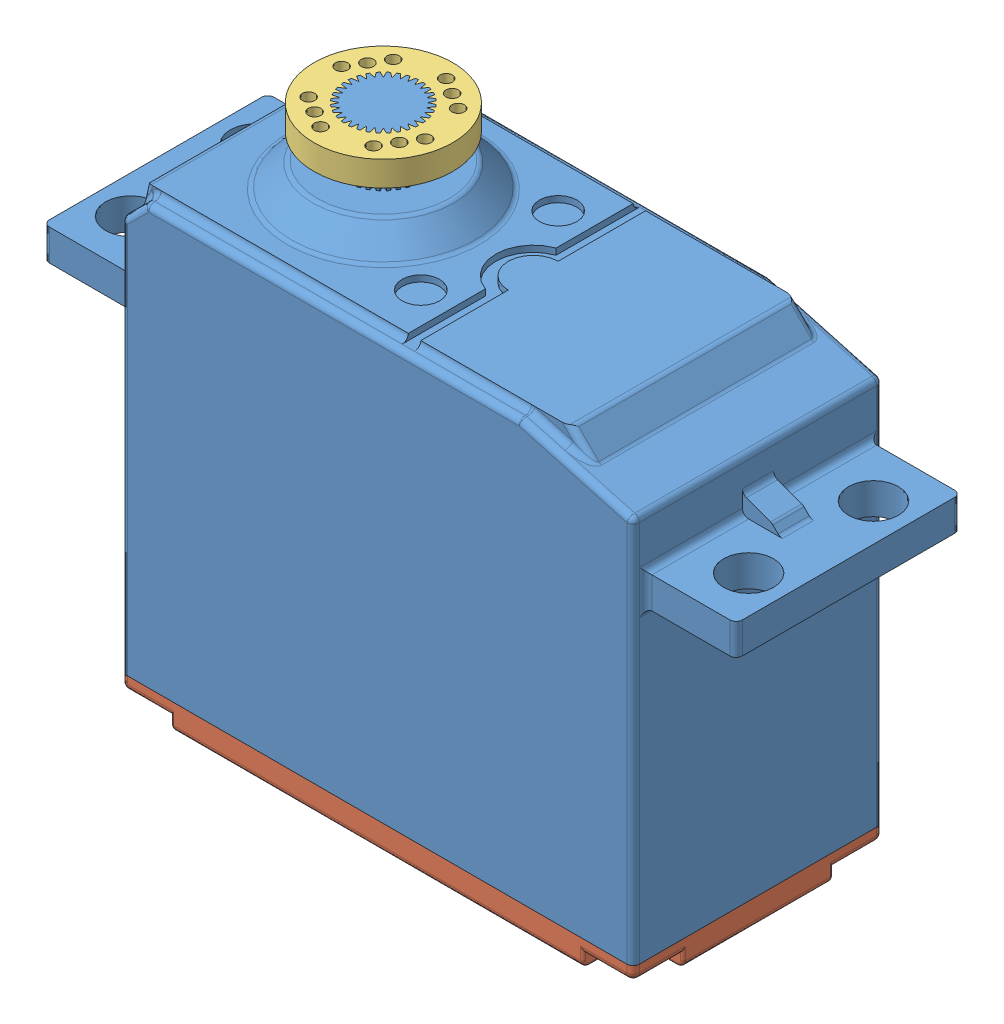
SolidWorks assembly FUTABA_S3003.SLDASM, configuration Default (file format 3400). Lengths in mm.
Overall size (55.5 42.1 20).
3 component instances, 3 part files, 3 mates.
Components (placement in the parent):
- corpo-1: corpo.SLDPRT [Default] at origin size (55.5 40 20)
- tampa-1: tampa.SLDPRT [Default] x (-1 0 0) z (0 -1 0) size (43 20 2.1)
- FUTM2020-2: FUTM2020.SLDPRT [Default] at (-9.5 40 0) x (0.848499 0 0.529197) z (0 -1 0) size (11.11 11.11 2)
Mates (geometry in assembly coordinates):
- Concentric3: concentric anti-aligned: cylinder of corpo-1; cylinder of FUTM2020-2
- Coincident4: coincident aligned: plane of corpo-1 through (-9.5 40 0) normal (0 1 0); plane of FUTM2020-2 through (-9.5 40 0) normal (0 1 0)
- Coincident5: coincident aligned: line of corpo-1; line of FUTM2020-2
